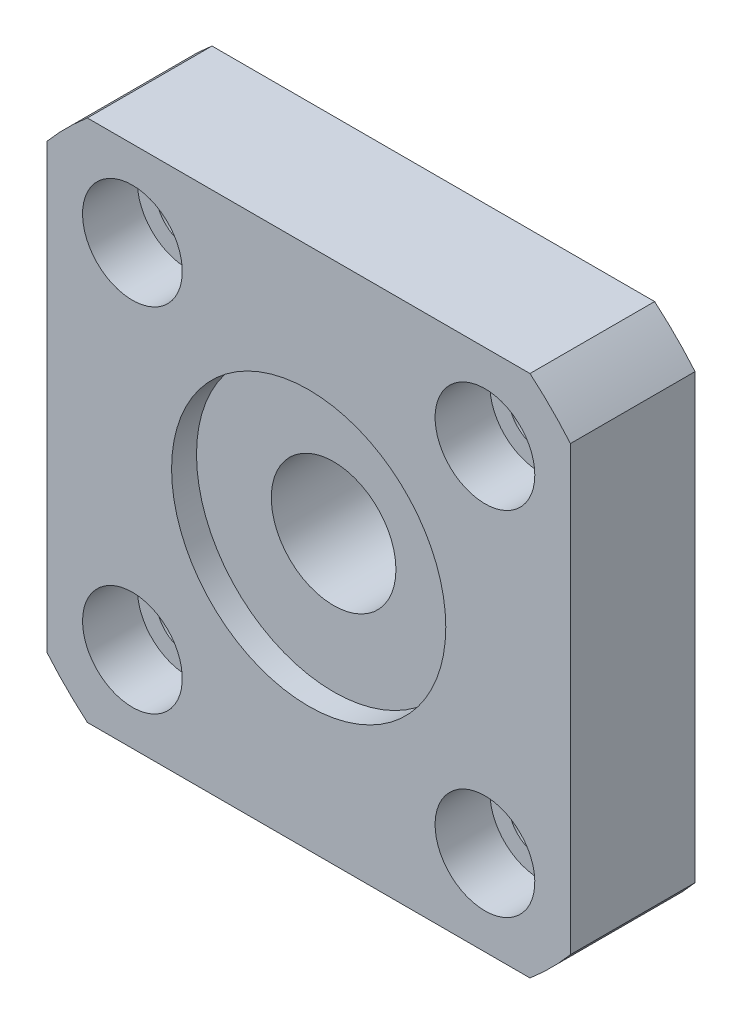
ISO-10303-21;
HEADER;
FILE_DESCRIPTION(('STEP AP214'),'2;1');
FILE_NAME('part.step','',(''),(''),'','','');
FILE_SCHEMA(('AUTOMOTIVE_DESIGN { 1 0 10303 214 1 1 1 1 }'));
ENDSEC;
DATA;
#1=APPLICATION_CONTEXT('core data for automotive mechanical design processes');
#2=APPLICATION_PROTOCOL_DEFINITION('international standard','automotive_design',2000,#1);
#3=PRODUCT_CONTEXT('',#1,'mechanical');
#4=PRODUCT('Part','Part','',(#3));
#5=PRODUCT_RELATED_PRODUCT_CATEGORY('part','',(#4));
#6=PRODUCT_DEFINITION_FORMATION('','',#4);
#7=PRODUCT_DEFINITION_CONTEXT('part definition',#1,'design');
#8=PRODUCT_DEFINITION('design','',#6,#7);
#9=PRODUCT_DEFINITION_SHAPE('','',#8);
#10=(LENGTH_UNIT() NAMED_UNIT(*) SI_UNIT(.MILLI.,.METRE.));
#11=(NAMED_UNIT(*) PLANE_ANGLE_UNIT() SI_UNIT($,.RADIAN.));
#12=(NAMED_UNIT(*) SI_UNIT($,.STERADIAN.) SOLID_ANGLE_UNIT());
#13=UNCERTAINTY_MEASURE_WITH_UNIT(LENGTH_MEASURE(1.E-05),#10,'distance_accuracy_value','');
#14=(GEOMETRIC_REPRESENTATION_CONTEXT(3) GLOBAL_UNCERTAINTY_ASSIGNED_CONTEXT((#13)) GLOBAL_UNIT_ASSIGNED_CONTEXT((#10,
#11,#12)) REPRESENTATION_CONTEXT('',''));
#15=CARTESIAN_POINT('',(0.,0.,0.));
#16=DIRECTION('',(0.,0.,1.));
#17=DIRECTION('',(1.,0.,0.));
#18=AXIS2_PLACEMENT_3D('',#15,#16,#17);
#19=CARTESIAN_POINT('',(0.,0.,10.));
#20=DIRECTION('',(0.,0.,-1.));
#21=DIRECTION('',(-1.,0.,0.));
#22=AXIS2_PLACEMENT_3D('',#19,#20,#21);
#23=CYLINDRICAL_SURFACE('',#22,5.);
#24=CARTESIAN_POINT('',(0.,0.,0.));
#25=DIRECTION('',(0.,0.,1.));
#26=DIRECTION('',(1.,0.,0.));
#27=AXIS2_PLACEMENT_3D('',#24,#25,#26);
#28=CIRCLE('',#27,5.);
#29=CARTESIAN_POINT('',(5.,0.,0.));
#30=VERTEX_POINT('',#29);
#31=EDGE_CURVE('E95',#30,#30,#28,.T.);
#32=ORIENTED_EDGE('',*,*,#31,.F.);
#33=EDGE_LOOP('',(#32));
#34=FACE_BOUND('',#33,.T.);
#35=CARTESIAN_POINT('',(0.,0.,8.));
#36=DIRECTION('',(0.,0.,1.));
#37=DIRECTION('',(1.,0.,0.));
#38=AXIS2_PLACEMENT_3D('',#35,#36,#37);
#39=CIRCLE('',#38,5.);
#40=CARTESIAN_POINT('',(5.,0.,8.));
#41=VERTEX_POINT('',#40);
#42=EDGE_CURVE('E18',#41,#41,#39,.T.);
#43=ORIENTED_EDGE('',*,*,#42,.T.);
#44=EDGE_LOOP('',(#43));
#45=FACE_BOUND('',#44,.T.);
#46=ADVANCED_FACE('F14',(#34,#45),#23,.F.);
#47=CARTESIAN_POINT('',(-14.1421356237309,14.142135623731,0.));
#48=DIRECTION('',(0.,0.,1.));
#49=DIRECTION('',(1.,0.,0.));
#50=AXIS2_PLACEMENT_3D('',#47,#48,#49);
#51=CYLINDRICAL_SURFACE('',#50,2.5);
#52=CARTESIAN_POINT('',(-14.1421356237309,14.142135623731,0.));
#53=DIRECTION('',(0.,0.,1.));
#54=DIRECTION('',(0.,1.,0.));
#55=AXIS2_PLACEMENT_3D('',#52,#53,#54);
#56=CIRCLE('',#55,2.5);
#57=CARTESIAN_POINT('',(-14.1421356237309,16.642135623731,0.));
#58=VERTEX_POINT('',#57);
#59=EDGE_CURVE('E154',#58,#58,#56,.T.);
#60=ORIENTED_EDGE('',*,*,#59,.F.);
#61=EDGE_LOOP('',(#60));
#62=FACE_BOUND('',#61,.T.);
#63=CARTESIAN_POINT('',(-14.1421356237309,14.142135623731,5.6));
#64=DIRECTION('',(0.,0.,1.));
#65=DIRECTION('',(1.,0.,0.));
#66=AXIS2_PLACEMENT_3D('',#63,#64,#65);
#67=CIRCLE('',#66,2.5);
#68=CARTESIAN_POINT('',(-11.6421356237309,14.142135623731,5.6));
#69=VERTEX_POINT('',#68);
#70=EDGE_CURVE('E160',#69,#69,#67,.F.);
#71=ORIENTED_EDGE('',*,*,#70,.F.);
#72=EDGE_LOOP('',(#71));
#73=FACE_BOUND('',#72,.T.);
#74=ADVANCED_FACE('F203',(#62,#73),#51,.F.);
#75=CARTESIAN_POINT('',(-14.142135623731,-14.1421356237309,0.));
#76=DIRECTION('',(0.,0.,1.));
#77=DIRECTION('',(1.,0.,0.));
#78=AXIS2_PLACEMENT_3D('',#75,#76,#77);
#79=CYLINDRICAL_SURFACE('',#78,2.5);
#80=CARTESIAN_POINT('',(-14.142135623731,-14.1421356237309,0.));
#81=DIRECTION('',(0.,0.,1.));
#82=DIRECTION('',(-1.,0.,0.));
#83=AXIS2_PLACEMENT_3D('',#80,#81,#82);
#84=CIRCLE('',#83,2.5);
#85=CARTESIAN_POINT('',(-16.642135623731,-14.1421356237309,0.));
#86=VERTEX_POINT('',#85);
#87=EDGE_CURVE('E185',#86,#86,#84,.T.);
#88=ORIENTED_EDGE('',*,*,#87,.F.);
#89=EDGE_LOOP('',(#88));
#90=FACE_BOUND('',#89,.T.);
#91=CARTESIAN_POINT('',(-14.142135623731,-14.1421356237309,5.6));
#92=DIRECTION('',(0.,0.,1.));
#93=DIRECTION('',(1.,0.,0.));
#94=AXIS2_PLACEMENT_3D('',#91,#92,#93);
#95=CIRCLE('',#94,2.5);
#96=CARTESIAN_POINT('',(-11.642135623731,-14.1421356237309,5.6));
#97=VERTEX_POINT('',#96);
#98=EDGE_CURVE('E156',#97,#97,#95,.F.);
#99=ORIENTED_EDGE('',*,*,#98,.F.);
#100=EDGE_LOOP('',(#99));
#101=FACE_BOUND('',#100,.T.);
#102=ADVANCED_FACE('F295',(#90,#101),#79,.F.);
#103=CARTESIAN_POINT('',(14.142135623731,-14.1421356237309,0.));
#104=DIRECTION('',(0.,0.,1.));
#105=DIRECTION('',(1.,0.,0.));
#106=AXIS2_PLACEMENT_3D('',#103,#104,#105);
#107=CYLINDRICAL_SURFACE('',#106,2.5);
#108=CARTESIAN_POINT('',(14.142135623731,-14.1421356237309,0.));
#109=DIRECTION('',(0.,0.,1.));
#110=DIRECTION('',(0.,-1.,0.));
#111=AXIS2_PLACEMENT_3D('',#108,#109,#110);
#112=CIRCLE('',#111,2.5);
#113=CARTESIAN_POINT('',(14.142135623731,-16.6421356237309,0.));
#114=VERTEX_POINT('',#113);
#115=EDGE_CURVE('E188',#114,#114,#112,.T.);
#116=ORIENTED_EDGE('',*,*,#115,.F.);
#117=EDGE_LOOP('',(#116));
#118=FACE_BOUND('',#117,.T.);
#119=CARTESIAN_POINT('',(14.142135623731,-14.1421356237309,5.6));
#120=DIRECTION('',(0.,0.,1.));
#121=DIRECTION('',(1.,0.,0.));
#122=AXIS2_PLACEMENT_3D('',#119,#120,#121);
#123=CIRCLE('',#122,2.5);
#124=CARTESIAN_POINT('',(16.642135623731,-14.1421356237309,5.6));
#125=VERTEX_POINT('',#124);
#126=EDGE_CURVE('E151',#125,#125,#123,.F.);
#127=ORIENTED_EDGE('',*,*,#126,.F.);
#128=EDGE_LOOP('',(#127));
#129=FACE_BOUND('',#128,.T.);
#130=ADVANCED_FACE('F283',(#118,#129),#107,.F.);
#131=CARTESIAN_POINT('',(14.1421356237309,14.142135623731,0.));
#132=DIRECTION('',(0.,0.,1.));
#133=DIRECTION('',(1.,0.,0.));
#134=AXIS2_PLACEMENT_3D('',#131,#132,#133);
#135=CYLINDRICAL_SURFACE('',#134,2.5);
#136=CARTESIAN_POINT('',(14.1421356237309,14.142135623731,0.));
#137=DIRECTION('',(0.,0.,1.));
#138=DIRECTION('',(1.,0.,0.));
#139=AXIS2_PLACEMENT_3D('',#136,#137,#138);
#140=CIRCLE('',#139,2.5);
#141=CARTESIAN_POINT('',(16.6421356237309,14.142135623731,0.));
#142=VERTEX_POINT('',#141);
#143=EDGE_CURVE('E149',#142,#142,#140,.T.);
#144=ORIENTED_EDGE('',*,*,#143,.F.);
#145=EDGE_LOOP('',(#144));
#146=FACE_BOUND('',#145,.T.);
#147=CARTESIAN_POINT('',(14.1421356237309,14.142135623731,5.6));
#148=DIRECTION('',(0.,0.,1.));
#149=DIRECTION('',(1.,0.,0.));
#150=AXIS2_PLACEMENT_3D('',#147,#148,#149);
#151=CIRCLE('',#150,2.5);
#152=CARTESIAN_POINT('',(16.6421356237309,14.142135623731,5.6));
#153=VERTEX_POINT('',#152);
#154=EDGE_CURVE('E146',#153,#153,#151,.F.);
#155=ORIENTED_EDGE('',*,*,#154,.F.);
#156=EDGE_LOOP('',(#155));
#157=FACE_BOUND('',#156,.T.);
#158=ADVANCED_FACE('F222',(#146,#157),#135,.F.);
#159=CARTESIAN_POINT('',(0.,0.,10.));
#160=DIRECTION('',(0.,0.,1.));
#161=DIRECTION('',(1.,0.,0.));
#162=AXIS2_PLACEMENT_3D('',#159,#160,#161);
#163=PLANE('',#162);
#164=CARTESIAN_POINT('',(0.,0.,10.));
#165=DIRECTION('',(0.,0.,1.));
#166=DIRECTION('',(1.,0.,0.));
#167=AXIS2_PLACEMENT_3D('',#164,#165,#166);
#168=CIRCLE('',#167,11.);
#169=CARTESIAN_POINT('',(11.,0.,10.));
#170=VERTEX_POINT('',#169);
#171=EDGE_CURVE('E210',#170,#170,#168,.T.);
#172=ORIENTED_EDGE('',*,*,#171,.F.);
#173=EDGE_LOOP('',(#172));
#174=FACE_BOUND('',#173,.T.);
#175=CARTESIAN_POINT('',(-14.1421356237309,14.142135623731,10.));
#176=DIRECTION('',(0.,0.,1.));
#177=DIRECTION('',(0.,1.,0.));
#178=AXIS2_PLACEMENT_3D('',#175,#176,#177);
#179=CIRCLE('',#178,4.);
#180=CARTESIAN_POINT('',(-14.1421356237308,18.142135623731,10.));
#181=VERTEX_POINT('',#180);
#182=EDGE_CURVE('E169',#181,#181,#179,.T.);
#183=ORIENTED_EDGE('',*,*,#182,.F.);
#184=EDGE_LOOP('',(#183));
#185=FACE_BOUND('',#184,.T.);
#186=CARTESIAN_POINT('',(-14.142135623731,-14.1421356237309,10.));
#187=DIRECTION('',(0.,0.,1.));
#188=DIRECTION('',(-1.,0.,0.));
#189=AXIS2_PLACEMENT_3D('',#186,#187,#188);
#190=CIRCLE('',#189,4.);
#191=CARTESIAN_POINT('',(-18.142135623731,-14.1421356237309,10.));
#192=VERTEX_POINT('',#191);
#193=EDGE_CURVE('E162',#192,#192,#190,.T.);
#194=ORIENTED_EDGE('',*,*,#193,.F.);
#195=EDGE_LOOP('',(#194));
#196=FACE_BOUND('',#195,.T.);
#197=CARTESIAN_POINT('',(14.142135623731,-14.1421356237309,10.));
#198=DIRECTION('',(0.,0.,1.));
#199=DIRECTION('',(0.,-1.,0.));
#200=AXIS2_PLACEMENT_3D('',#197,#198,#199);
#201=CIRCLE('',#200,4.);
#202=CARTESIAN_POINT('',(14.142135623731,-18.1421356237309,10.));
#203=VERTEX_POINT('',#202);
#204=EDGE_CURVE('E158',#203,#203,#201,.T.);
#205=ORIENTED_EDGE('',*,*,#204,.F.);
#206=EDGE_LOOP('',(#205));
#207=FACE_BOUND('',#206,.T.);
#208=CARTESIAN_POINT('',(14.1421356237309,14.142135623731,10.));
#209=DIRECTION('',(0.,0.,1.));
#210=DIRECTION('',(1.,0.,0.));
#211=AXIS2_PLACEMENT_3D('',#208,#209,#210);
#212=CIRCLE('',#211,4.);
#213=CARTESIAN_POINT('',(18.1421356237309,14.142135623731,10.));
#214=VERTEX_POINT('',#213);
#215=EDGE_CURVE('E191',#214,#214,#212,.T.);
#216=ORIENTED_EDGE('',*,*,#215,.F.);
#217=EDGE_LOOP('',(#216));
#218=FACE_BOUND('',#217,.T.);
#219=CARTESIAN_POINT('',(0.,0.,10.));
#220=DIRECTION('',(0.,0.,1.));
#221=DIRECTION('',(1.,0.,0.));
#222=AXIS2_PLACEMENT_3D('',#219,#220,#221);
#223=CIRCLE('',#222,27.5);
#224=CARTESIAN_POINT('',(21.,17.7552809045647,10.));
#225=VERTEX_POINT('',#224);
#226=CARTESIAN_POINT('',(17.7552809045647,21.,10.));
#227=VERTEX_POINT('',#226);
#228=EDGE_CURVE('E119',#225,#227,#223,.T.);
#229=ORIENTED_EDGE('',*,*,#228,.T.);
#230=DIRECTION('',(-1.,0.,0.));
#231=VECTOR('',#230,1.);
#232=CARTESIAN_POINT('',(17.7552809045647,21.,10.));
#233=LINE('',#232,#231);
#234=CARTESIAN_POINT('',(-17.7552809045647,21.,10.));
#235=VERTEX_POINT('',#234);
#236=EDGE_CURVE('E87',#227,#235,#233,.T.);
#237=ORIENTED_EDGE('',*,*,#236,.T.);
#238=CARTESIAN_POINT('',(0.,0.,10.));
#239=DIRECTION('',(0.,0.,-1.));
#240=DIRECTION('',(-1.,0.,0.));
#241=AXIS2_PLACEMENT_3D('',#238,#239,#240);
#242=CIRCLE('',#241,27.5);
#243=CARTESIAN_POINT('',(-21.,17.7552809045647,10.));
#244=VERTEX_POINT('',#243);
#245=EDGE_CURVE('E121',#244,#235,#242,.T.);
#246=ORIENTED_EDGE('',*,*,#245,.F.);
#247=DIRECTION('',(0.,-1.,0.));
#248=VECTOR('',#247,1.);
#249=CARTESIAN_POINT('',(-21.,17.7552809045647,10.));
#250=LINE('',#249,#248);
#251=CARTESIAN_POINT('',(-21.,-17.7552809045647,10.));
#252=VERTEX_POINT('',#251);
#253=EDGE_CURVE('E122',#244,#252,#250,.T.);
#254=ORIENTED_EDGE('',*,*,#253,.T.);
#255=CARTESIAN_POINT('',(-17.7552809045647,-21.,10.));
#256=VERTEX_POINT('',#255);
#257=EDGE_CURVE('E125',#252,#256,#223,.T.);
#258=ORIENTED_EDGE('',*,*,#257,.T.);
#259=DIRECTION('',(-1.,0.,0.));
#260=VECTOR('',#259,1.);
#261=CARTESIAN_POINT('',(17.7552809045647,-21.,10.));
#262=LINE('',#261,#260);
#263=CARTESIAN_POINT('',(17.7552809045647,-21.,10.));
#264=VERTEX_POINT('',#263);
#265=EDGE_CURVE('E128',#264,#256,#262,.T.);
#266=ORIENTED_EDGE('',*,*,#265,.F.);
#267=CARTESIAN_POINT('',(21.,-17.7552809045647,10.));
#268=VERTEX_POINT('',#267);
#269=EDGE_CURVE('E131',#268,#264,#242,.T.);
#270=ORIENTED_EDGE('',*,*,#269,.F.);
#271=DIRECTION('',(0.,-1.,0.));
#272=VECTOR('',#271,1.);
#273=CARTESIAN_POINT('',(21.,17.7552809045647,10.));
#274=LINE('',#273,#272);
#275=EDGE_CURVE('E133',#225,#268,#274,.T.);
#276=ORIENTED_EDGE('',*,*,#275,.F.);
#277=EDGE_LOOP('',(#229,#237,#246,#254,#258,#266,#270,#276));
#278=FACE_BOUND('',#277,.T.);
#279=ADVANCED_FACE('F219',(#174,#185,#196,#207,#218,#278),#163,.T.);
#280=CARTESIAN_POINT('',(0.,0.,0.));
#281=DIRECTION('',(0.,0.,1.));
#282=DIRECTION('',(1.,0.,0.));
#283=AXIS2_PLACEMENT_3D('',#280,#281,#282);
#284=PLANE('',#283);
#285=ORIENTED_EDGE('',*,*,#59,.T.);
#286=EDGE_LOOP('',(#285));
#287=FACE_BOUND('',#286,.T.);
#288=ORIENTED_EDGE('',*,*,#87,.T.);
#289=EDGE_LOOP('',(#288));
#290=FACE_BOUND('',#289,.T.);
#291=ORIENTED_EDGE('',*,*,#115,.T.);
#292=EDGE_LOOP('',(#291));
#293=FACE_BOUND('',#292,.T.);
#294=ORIENTED_EDGE('',*,*,#143,.T.);
#295=EDGE_LOOP('',(#294));
#296=FACE_BOUND('',#295,.T.);
#297=CARTESIAN_POINT('',(0.,0.,0.));
#298=DIRECTION('',(0.,0.,1.));
#299=DIRECTION('',(1.,0.,0.));
#300=AXIS2_PLACEMENT_3D('',#297,#298,#299);
#301=CIRCLE('',#300,27.5);
#302=CARTESIAN_POINT('',(21.,17.7552809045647,0.));
#303=VERTEX_POINT('',#302);
#304=CARTESIAN_POINT('',(17.7552809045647,21.,0.));
#305=VERTEX_POINT('',#304);
#306=EDGE_CURVE('E91',#303,#305,#301,.T.);
#307=ORIENTED_EDGE('',*,*,#306,.F.);
#308=DIRECTION('',(0.,-1.,0.));
#309=VECTOR('',#308,1.);
#310=CARTESIAN_POINT('',(21.,17.7552809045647,0.));
#311=LINE('',#310,#309);
#312=CARTESIAN_POINT('',(21.,-17.7552809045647,0.));
#313=VERTEX_POINT('',#312);
#314=EDGE_CURVE('E117',#303,#313,#311,.T.);
#315=ORIENTED_EDGE('',*,*,#314,.T.);
#316=CARTESIAN_POINT('',(0.,0.,0.));
#317=DIRECTION('',(0.,0.,-1.));
#318=DIRECTION('',(-1.,0.,0.));
#319=AXIS2_PLACEMENT_3D('',#316,#317,#318);
#320=CIRCLE('',#319,27.5);
#321=CARTESIAN_POINT('',(17.7552809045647,-21.,0.));
#322=VERTEX_POINT('',#321);
#323=EDGE_CURVE('E106',#313,#322,#320,.T.);
#324=ORIENTED_EDGE('',*,*,#323,.T.);
#325=DIRECTION('',(-1.,0.,0.));
#326=VECTOR('',#325,1.);
#327=CARTESIAN_POINT('',(17.7552809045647,-21.,0.));
#328=LINE('',#327,#326);
#329=CARTESIAN_POINT('',(-17.7552809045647,-21.,0.));
#330=VERTEX_POINT('',#329);
#331=EDGE_CURVE('E113',#322,#330,#328,.T.);
#332=ORIENTED_EDGE('',*,*,#331,.T.);
#333=CARTESIAN_POINT('',(-21.,-17.7552809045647,0.));
#334=VERTEX_POINT('',#333);
#335=EDGE_CURVE('E97',#334,#330,#301,.T.);
#336=ORIENTED_EDGE('',*,*,#335,.F.);
#337=DIRECTION('',(0.,-1.,0.));
#338=VECTOR('',#337,1.);
#339=CARTESIAN_POINT('',(-21.,17.7552809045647,0.));
#340=LINE('',#339,#338);
#341=CARTESIAN_POINT('',(-21.,17.7552809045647,0.));
#342=VERTEX_POINT('',#341);
#343=EDGE_CURVE('E104',#342,#334,#340,.T.);
#344=ORIENTED_EDGE('',*,*,#343,.F.);
#345=CARTESIAN_POINT('',(-17.7552809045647,21.,0.));
#346=VERTEX_POINT('',#345);
#347=EDGE_CURVE('E102',#342,#346,#320,.T.);
#348=ORIENTED_EDGE('',*,*,#347,.T.);
#349=DIRECTION('',(-1.,0.,0.));
#350=VECTOR('',#349,1.);
#351=CARTESIAN_POINT('',(17.7552809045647,21.,0.));
#352=LINE('',#351,#350);
#353=EDGE_CURVE('E84',#305,#346,#352,.T.);
#354=ORIENTED_EDGE('',*,*,#353,.F.);
#355=EDGE_LOOP('',(#307,#315,#324,#332,#336,#344,#348,#354));
#356=FACE_BOUND('',#355,.T.);
#357=ORIENTED_EDGE('',*,*,#31,.T.);
#358=EDGE_LOOP('',(#357));
#359=FACE_BOUND('',#358,.T.);
#360=ADVANCED_FACE('F98',(#287,#290,#293,#296,#356,#359),#284,.F.);
#361=CARTESIAN_POINT('',(0.,0.,10.));
#362=DIRECTION('',(0.,0.,-1.));
#363=DIRECTION('',(-1.,0.,0.));
#364=AXIS2_PLACEMENT_3D('',#361,#362,#363);
#365=CYLINDRICAL_SURFACE('',#364,27.5);
#366=DIRECTION('',(0.,0.,-1.));
#367=VECTOR('',#366,1.);
#368=CARTESIAN_POINT('',(17.7552809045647,21.,10.));
#369=LINE('',#368,#367);
#370=EDGE_CURVE('E9',#227,#305,#369,.T.);
#371=ORIENTED_EDGE('',*,*,#370,.F.);
#372=ORIENTED_EDGE('',*,*,#228,.F.);
#373=DIRECTION('',(0.,0.,-1.));
#374=VECTOR('',#373,1.);
#375=CARTESIAN_POINT('',(21.,17.7552809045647,10.));
#376=LINE('',#375,#374);
#377=EDGE_CURVE('E31',#225,#303,#376,.T.);
#378=ORIENTED_EDGE('',*,*,#377,.T.);
#379=ORIENTED_EDGE('',*,*,#306,.T.);
#380=EDGE_LOOP('',(#371,#372,#378,#379));
#381=FACE_BOUND('',#380,.T.);
#382=ADVANCED_FACE('F92',(#381),#365,.T.);
#383=CARTESIAN_POINT('',(17.7552809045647,21.,10.));
#384=DIRECTION('',(0.,-1.,0.));
#385=DIRECTION('',(0.,0.,-1.));
#386=AXIS2_PLACEMENT_3D('',#383,#384,#385);
#387=PLANE('',#386);
#388=DIRECTION('',(0.,0.,-1.));
#389=VECTOR('',#388,1.);
#390=CARTESIAN_POINT('',(-17.7552809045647,21.,10.));
#391=LINE('',#390,#389);
#392=EDGE_CURVE('E23',#235,#346,#391,.T.);
#393=ORIENTED_EDGE('',*,*,#392,.F.);
#394=ORIENTED_EDGE('',*,*,#236,.F.);
#395=ORIENTED_EDGE('',*,*,#370,.T.);
#396=ORIENTED_EDGE('',*,*,#353,.T.);
#397=EDGE_LOOP('',(#393,#394,#395,#396));
#398=FACE_BOUND('',#397,.T.);
#399=ADVANCED_FACE('F16',(#398),#387,.F.);
#400=CARTESIAN_POINT('',(0.,0.,10.));
#401=DIRECTION('',(0.,0.,-1.));
#402=DIRECTION('',(-1.,0.,0.));
#403=AXIS2_PLACEMENT_3D('',#400,#401,#402);
#404=CYLINDRICAL_SURFACE('',#403,27.5);
#405=DIRECTION('',(0.,0.,-1.));
#406=VECTOR('',#405,1.);
#407=CARTESIAN_POINT('',(-21.,17.7552809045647,10.));
#408=LINE('',#407,#406);
#409=EDGE_CURVE('E143',#244,#342,#408,.T.);
#410=ORIENTED_EDGE('',*,*,#409,.F.);
#411=ORIENTED_EDGE('',*,*,#245,.T.);
#412=ORIENTED_EDGE('',*,*,#392,.T.);
#413=ORIENTED_EDGE('',*,*,#347,.F.);
#414=EDGE_LOOP('',(#410,#411,#412,#413));
#415=FACE_BOUND('',#414,.T.);
#416=ADVANCED_FACE('F249',(#415),#404,.T.);
#417=CARTESIAN_POINT('',(-21.,17.7552809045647,10.));
#418=DIRECTION('',(1.,0.,0.));
#419=DIRECTION('',(0.,0.,-1.));
#420=AXIS2_PLACEMENT_3D('',#417,#418,#419);
#421=PLANE('',#420);
#422=DIRECTION('',(0.,0.,-1.));
#423=VECTOR('',#422,1.);
#424=CARTESIAN_POINT('',(-21.,-17.7552809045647,10.));
#425=LINE('',#424,#423);
#426=EDGE_CURVE('E141',#252,#334,#425,.T.);
#427=ORIENTED_EDGE('',*,*,#426,.F.);
#428=ORIENTED_EDGE('',*,*,#253,.F.);
#429=ORIENTED_EDGE('',*,*,#409,.T.);
#430=ORIENTED_EDGE('',*,*,#343,.T.);
#431=EDGE_LOOP('',(#427,#428,#429,#430));
#432=FACE_BOUND('',#431,.T.);
#433=ADVANCED_FACE('F247',(#432),#421,.F.);
#434=DIRECTION('',(0.,0.,-1.));
#435=VECTOR('',#434,1.);
#436=CARTESIAN_POINT('',(-17.7552809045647,-21.,10.));
#437=LINE('',#436,#435);
#438=EDGE_CURVE('E139',#256,#330,#437,.T.);
#439=ORIENTED_EDGE('',*,*,#438,.F.);
#440=ORIENTED_EDGE('',*,*,#257,.F.);
#441=ORIENTED_EDGE('',*,*,#426,.T.);
#442=ORIENTED_EDGE('',*,*,#335,.T.);
#443=EDGE_LOOP('',(#439,#440,#441,#442));
#444=FACE_BOUND('',#443,.T.);
#445=ADVANCED_FACE('F244',(#444),#365,.T.);
#446=CARTESIAN_POINT('',(17.7552809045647,-21.,10.));
#447=DIRECTION('',(0.,-1.,0.));
#448=DIRECTION('',(0.,0.,-1.));
#449=AXIS2_PLACEMENT_3D('',#446,#447,#448);
#450=PLANE('',#449);
#451=DIRECTION('',(0.,0.,-1.));
#452=VECTOR('',#451,1.);
#453=CARTESIAN_POINT('',(17.7552809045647,-21.,10.));
#454=LINE('',#453,#452);
#455=EDGE_CURVE('E137',#264,#322,#454,.T.);
#456=ORIENTED_EDGE('',*,*,#455,.F.);
#457=ORIENTED_EDGE('',*,*,#265,.T.);
#458=ORIENTED_EDGE('',*,*,#438,.T.);
#459=ORIENTED_EDGE('',*,*,#331,.F.);
#460=EDGE_LOOP('',(#456,#457,#458,#459));
#461=FACE_BOUND('',#460,.T.);
#462=ADVANCED_FACE('F241',(#461),#450,.T.);
#463=DIRECTION('',(0.,0.,-1.));
#464=VECTOR('',#463,1.);
#465=CARTESIAN_POINT('',(21.,-17.7552809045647,10.));
#466=LINE('',#465,#464);
#467=EDGE_CURVE('E39',#268,#313,#466,.T.);
#468=ORIENTED_EDGE('',*,*,#467,.F.);
#469=ORIENTED_EDGE('',*,*,#269,.T.);
#470=ORIENTED_EDGE('',*,*,#455,.T.);
#471=ORIENTED_EDGE('',*,*,#323,.F.);
#472=EDGE_LOOP('',(#468,#469,#470,#471));
#473=FACE_BOUND('',#472,.T.);
#474=ADVANCED_FACE('F237',(#473),#404,.T.);
#475=CARTESIAN_POINT('',(21.,17.7552809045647,10.));
#476=DIRECTION('',(1.,0.,0.));
#477=DIRECTION('',(0.,0.,-1.));
#478=AXIS2_PLACEMENT_3D('',#475,#476,#477);
#479=PLANE('',#478);
#480=ORIENTED_EDGE('',*,*,#275,.T.);
#481=ORIENTED_EDGE('',*,*,#467,.T.);
#482=ORIENTED_EDGE('',*,*,#314,.F.);
#483=ORIENTED_EDGE('',*,*,#377,.F.);
#484=EDGE_LOOP('',(#480,#481,#482,#483));
#485=FACE_BOUND('',#484,.T.);
#486=ADVANCED_FACE('F236',(#485),#479,.T.);
#487=CARTESIAN_POINT('',(14.1421356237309,14.142135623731,5.6));
#488=DIRECTION('',(0.,0.,1.));
#489=DIRECTION('',(1.,0.,0.));
#490=AXIS2_PLACEMENT_3D('',#487,#488,#489);
#491=PLANE('',#490);
#492=CARTESIAN_POINT('',(14.1421356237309,14.142135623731,5.6));
#493=DIRECTION('',(0.,0.,1.));
#494=DIRECTION('',(1.,0.,0.));
#495=AXIS2_PLACEMENT_3D('',#492,#493,#494);
#496=CIRCLE('',#495,4.);
#497=CARTESIAN_POINT('',(18.1421356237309,14.142135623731,5.6));
#498=VERTEX_POINT('',#497);
#499=EDGE_CURVE('E150',#498,#498,#496,.T.);
#500=ORIENTED_EDGE('',*,*,#499,.T.);
#501=EDGE_LOOP('',(#500));
#502=FACE_BOUND('',#501,.T.);
#503=ORIENTED_EDGE('',*,*,#154,.T.);
#504=EDGE_LOOP('',(#503));
#505=FACE_BOUND('',#504,.T.);
#506=ADVANCED_FACE('F264',(#502,#505),#491,.T.);
#507=CARTESIAN_POINT('',(14.1421356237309,14.142135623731,5.6));
#508=DIRECTION('',(0.,0.,1.));
#509=DIRECTION('',(1.,0.,0.));
#510=AXIS2_PLACEMENT_3D('',#507,#508,#509);
#511=CYLINDRICAL_SURFACE('',#510,4.);
#512=ORIENTED_EDGE('',*,*,#499,.F.);
#513=EDGE_LOOP('',(#512));
#514=FACE_BOUND('',#513,.T.);
#515=ORIENTED_EDGE('',*,*,#215,.T.);
#516=EDGE_LOOP('',(#515));
#517=FACE_BOUND('',#516,.T.);
#518=ADVANCED_FACE('F285',(#514,#517),#511,.F.);
#519=CARTESIAN_POINT('',(14.142135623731,-14.1421356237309,5.6));
#520=DIRECTION('',(0.,0.,1.));
#521=DIRECTION('',(1.,0.,0.));
#522=AXIS2_PLACEMENT_3D('',#519,#520,#521);
#523=PLANE('',#522);
#524=CARTESIAN_POINT('',(14.142135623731,-14.1421356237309,5.6));
#525=DIRECTION('',(0.,0.,1.));
#526=DIRECTION('',(0.,-1.,0.));
#527=AXIS2_PLACEMENT_3D('',#524,#525,#526);
#528=CIRCLE('',#527,4.);
#529=CARTESIAN_POINT('',(14.142135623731,-18.1421356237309,5.6));
#530=VERTEX_POINT('',#529);
#531=EDGE_CURVE('E155',#530,#530,#528,.T.);
#532=ORIENTED_EDGE('',*,*,#531,.T.);
#533=EDGE_LOOP('',(#532));
#534=FACE_BOUND('',#533,.T.);
#535=ORIENTED_EDGE('',*,*,#126,.T.);
#536=EDGE_LOOP('',(#535));
#537=FACE_BOUND('',#536,.T.);
#538=ADVANCED_FACE('F288',(#534,#537),#523,.T.);
#539=CARTESIAN_POINT('',(14.142135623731,-14.1421356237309,5.6));
#540=DIRECTION('',(0.,0.,1.));
#541=DIRECTION('',(1.,0.,0.));
#542=AXIS2_PLACEMENT_3D('',#539,#540,#541);
#543=CYLINDRICAL_SURFACE('',#542,4.);
#544=ORIENTED_EDGE('',*,*,#531,.F.);
#545=EDGE_LOOP('',(#544));
#546=FACE_BOUND('',#545,.T.);
#547=ORIENTED_EDGE('',*,*,#204,.T.);
#548=EDGE_LOOP('',(#547));
#549=FACE_BOUND('',#548,.T.);
#550=ADVANCED_FACE('F303',(#546,#549),#543,.F.);
#551=CARTESIAN_POINT('',(-14.142135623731,-14.1421356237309,5.6));
#552=DIRECTION('',(0.,0.,1.));
#553=DIRECTION('',(1.,0.,0.));
#554=AXIS2_PLACEMENT_3D('',#551,#552,#553);
#555=PLANE('',#554);
#556=CARTESIAN_POINT('',(-14.142135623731,-14.1421356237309,5.6));
#557=DIRECTION('',(0.,0.,1.));
#558=DIRECTION('',(-1.,0.,0.));
#559=AXIS2_PLACEMENT_3D('',#556,#557,#558);
#560=CIRCLE('',#559,4.);
#561=CARTESIAN_POINT('',(-18.142135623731,-14.1421356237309,5.6));
#562=VERTEX_POINT('',#561);
#563=EDGE_CURVE('E159',#562,#562,#560,.T.);
#564=ORIENTED_EDGE('',*,*,#563,.T.);
#565=EDGE_LOOP('',(#564));
#566=FACE_BOUND('',#565,.T.);
#567=ORIENTED_EDGE('',*,*,#98,.T.);
#568=EDGE_LOOP('',(#567));
#569=FACE_BOUND('',#568,.T.);
#570=ADVANCED_FACE('F306',(#566,#569),#555,.T.);
#571=CARTESIAN_POINT('',(-14.142135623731,-14.1421356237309,5.6));
#572=DIRECTION('',(0.,0.,1.));
#573=DIRECTION('',(1.,0.,0.));
#574=AXIS2_PLACEMENT_3D('',#571,#572,#573);
#575=CYLINDRICAL_SURFACE('',#574,4.);
#576=ORIENTED_EDGE('',*,*,#563,.F.);
#577=EDGE_LOOP('',(#576));
#578=FACE_BOUND('',#577,.T.);
#579=ORIENTED_EDGE('',*,*,#193,.T.);
#580=EDGE_LOOP('',(#579));
#581=FACE_BOUND('',#580,.T.);
#582=ADVANCED_FACE('F311',(#578,#581),#575,.F.);
#583=CARTESIAN_POINT('',(-14.1421356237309,14.142135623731,5.6));
#584=DIRECTION('',(0.,0.,1.));
#585=DIRECTION('',(1.,0.,0.));
#586=AXIS2_PLACEMENT_3D('',#583,#584,#585);
#587=PLANE('',#586);
#588=CARTESIAN_POINT('',(-14.1421356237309,14.142135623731,5.6));
#589=DIRECTION('',(0.,0.,1.));
#590=DIRECTION('',(0.,1.,0.));
#591=AXIS2_PLACEMENT_3D('',#588,#589,#590);
#592=CIRCLE('',#591,4.);
#593=CARTESIAN_POINT('',(-14.1421356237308,18.142135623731,5.6));
#594=VERTEX_POINT('',#593);
#595=EDGE_CURVE('E163',#594,#594,#592,.T.);
#596=ORIENTED_EDGE('',*,*,#595,.T.);
#597=EDGE_LOOP('',(#596));
#598=FACE_BOUND('',#597,.T.);
#599=ORIENTED_EDGE('',*,*,#70,.T.);
#600=EDGE_LOOP('',(#599));
#601=FACE_BOUND('',#600,.T.);
#602=ADVANCED_FACE('F314',(#598,#601),#587,.T.);
#603=CARTESIAN_POINT('',(-14.1421356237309,14.142135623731,5.6));
#604=DIRECTION('',(0.,0.,1.));
#605=DIRECTION('',(1.,0.,0.));
#606=AXIS2_PLACEMENT_3D('',#603,#604,#605);
#607=CYLINDRICAL_SURFACE('',#606,4.);
#608=ORIENTED_EDGE('',*,*,#595,.F.);
#609=EDGE_LOOP('',(#608));
#610=FACE_BOUND('',#609,.T.);
#611=ORIENTED_EDGE('',*,*,#182,.T.);
#612=EDGE_LOOP('',(#611));
#613=FACE_BOUND('',#612,.T.);
#614=ADVANCED_FACE('F319',(#610,#613),#607,.F.);
#615=CARTESIAN_POINT('',(0.,0.,8.));
#616=DIRECTION('',(0.,0.,1.));
#617=DIRECTION('',(1.,0.,0.));
#618=AXIS2_PLACEMENT_3D('',#615,#616,#617);
#619=CYLINDRICAL_SURFACE('',#618,11.);
#620=CARTESIAN_POINT('',(0.,0.,8.));
#621=DIRECTION('',(0.,0.,1.));
#622=DIRECTION('',(1.,0.,0.));
#623=AXIS2_PLACEMENT_3D('',#620,#621,#622);
#624=CIRCLE('',#623,11.);
#625=CARTESIAN_POINT('',(11.,0.,8.));
#626=VERTEX_POINT('',#625);
#627=EDGE_CURVE('E208',#626,#626,#624,.T.);
#628=ORIENTED_EDGE('',*,*,#627,.F.);
#629=EDGE_LOOP('',(#628));
#630=FACE_BOUND('',#629,.T.);
#631=ORIENTED_EDGE('',*,*,#171,.T.);
#632=EDGE_LOOP('',(#631));
#633=FACE_BOUND('',#632,.T.);
#634=ADVANCED_FACE('F217',(#630,#633),#619,.F.);
#635=CARTESIAN_POINT('',(0.,0.,8.));
#636=DIRECTION('',(0.,0.,1.));
#637=DIRECTION('',(1.,0.,0.));
#638=AXIS2_PLACEMENT_3D('',#635,#636,#637);
#639=PLANE('',#638);
#640=ORIENTED_EDGE('',*,*,#42,.F.);
#641=EDGE_LOOP('',(#640));
#642=FACE_BOUND('',#641,.T.);
#643=ORIENTED_EDGE('',*,*,#627,.T.);
#644=EDGE_LOOP('',(#643));
#645=FACE_BOUND('',#644,.T.);
#646=ADVANCED_FACE('F323',(#642,#645),#639,.T.);
#647=CLOSED_SHELL('',(#46,#74,#102,#130,#158,#279,#360,#382,#399,#416,#433,#445,#462,#474,#486,
#506,#518,#538,#550,#570,#582,#602,#614,#634,#646));
#648=MANIFOLD_SOLID_BREP('B1',#647);
#649=ADVANCED_BREP_SHAPE_REPRESENTATION('',(#18,#648),#14);
#650=SHAPE_DEFINITION_REPRESENTATION(#9,#649);
ENDSEC;
END-ISO-10303-21;
